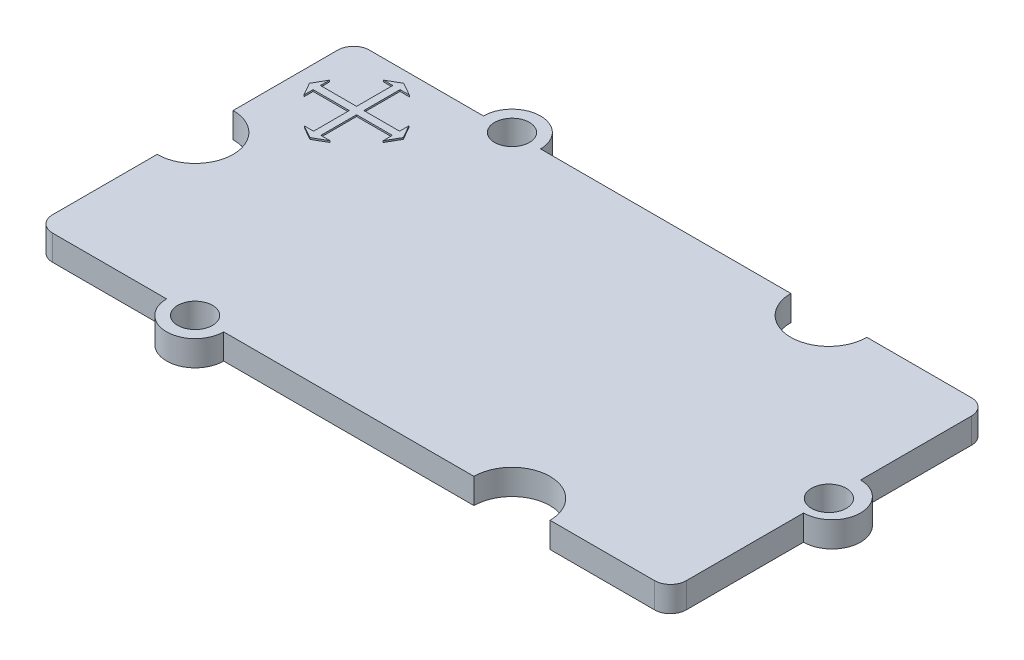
from build123d import *

# Parameters (mm, degrees)
ESQUISSE1_R      = 1.1
EXTRUSION1_DEPTH = 1.6
EXTRUSION2_DEPTH = 0.1


with BuildPart() as part:
    # Esquisse1 → Extrusion1 (new body)
    with BuildSketch(Plane.XZ):
        with BuildLine():
            Line((-39.699723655, 0), (-55.499723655, 0))
            ThreePointArc((-55.499723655, 0), (-57.299723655, -1.8), (-59.099723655, 0))
            Line((-59.099723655, 0), (-66.299723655, 0))
            ThreePointArc((-66.299723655, 0), (-67.006830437, 0.292893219), (-67.299723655, 1))
            Line((-67.299723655, 1), (-67.299723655, 7.6))
            ThreePointArc((-67.299723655, 7.6), (-64.899723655, 10), (-67.299723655, 12.4))
            Line((-67.299723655, 12.4), (-67.299723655, 19))
            ThreePointArc((-67.299723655, 19), (-67.006830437, 19.707106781), (-66.299723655, 20))
            Line((-66.299723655, 20), (-59.099723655, 20))
            ThreePointArc((-59.099723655, 20), (-57.299723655, 21.8), (-55.499723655, 20))
            Line((-55.499723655, 20), (-39.699723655, 20))
            ThreePointArc((-39.699723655, 20), (-37.299723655, 17.6), (-34.899723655, 20))
            Line((-34.899723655, 20), (-28.299723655, 20))
            ThreePointArc((-28.299723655, 20), (-27.592616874, 19.707106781), (-27.299723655, 19))
            Line((-27.299723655, 19), (-27.299723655, 11.6))
            ThreePointArc((-27.299723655, 11.6), (-25.499723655, 9.8), (-27.299723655, 8))
            Line((-27.299723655, 8), (-27.299723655, 1))
            ThreePointArc((-27.299723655, 1), (-27.592616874, 0.292893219), (-28.299723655, 0))
            Line((-28.299723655, 0), (-34.899723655, 0))
            ThreePointArc((-34.899723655, 0), (-37.299723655, 2.4), (-39.699723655, 0))
        make_face()
        with Locations(Location((-57.299723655, 0, 0), (0, 0, 270))):
            Circle(ESQUISSE1_R, mode=Mode.SUBTRACT)
        with Locations(Location((-57.299723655, 20, 0), (0, 0, 90))):
            Circle(ESQUISSE1_R, mode=Mode.SUBTRACT)
        with Locations(Location((-27.299723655, 10, 0), (0, 0, 90))):
            Circle(ESQUISSE1_R, mode=Mode.SUBTRACT)
    extrude(amount=EXTRUSION1_DEPTH)

    # Esquisse2 → Extrusion2 (add)
    with BuildSketch(Plane(origin=(0, 0, 0), x_dir=(-1, 0, 0), z_dir=(0, 1, 0))):
        Polygon((62.487708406, 1.294535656), (63.299723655, 0.830474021), (64.111738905, 1.294535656), (63.52877996, 1.294535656), (63.52877996, 3.580986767), (63.52877996, 4.037451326), (63.52877996, 6.294535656), (64.111738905, 6.294535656), (63.299723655, 6.758597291), (62.487708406, 6.294535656), (63.072315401, 6.294535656), (63.072315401, 4.037451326), (60.81358302, 4.037451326), (60.81358302, 4.620410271), (60.349521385, 3.808395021), (60.81358302, 2.996379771), (60.81358302, 3.580986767), (63.072315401, 3.580986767), (63.072315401, 1.294535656), align=None)
        Polygon((63.52877996, 4.037451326), (63.52877996, 3.580986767), (65.81358302, 3.580986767), (65.81358302, 2.996379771), (66.277644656, 3.808395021), (65.81358302, 4.620410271), (65.81358302, 4.037451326), align=None)
    extrude(amount=EXTRUSION2_DEPTH)


solid = part.part
